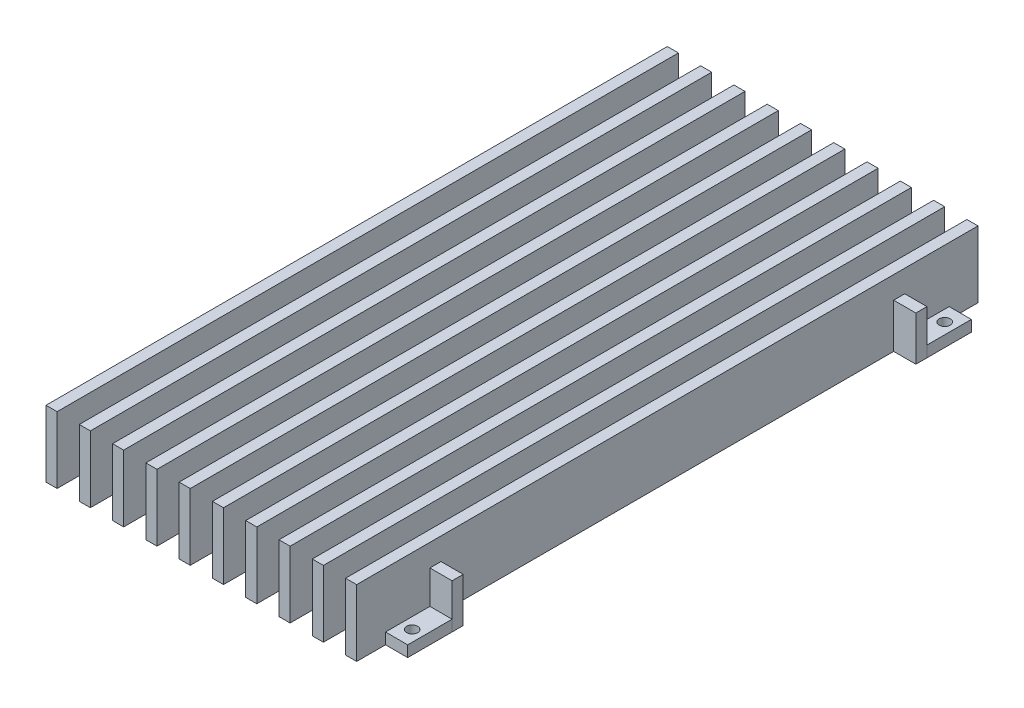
from build123d import *

# Parameters (mm, degrees)
SKETCH1_W             = 3.175
SKETCH1_H             = 19.05
BOSS_EXTRUDE1_DEPTH   = 177.8
LPATTERN1_COUNT       = 10
LPATTERN1_PITCH       = 9.525
SKETCH2_W             = 3.175
SKETCH2_H             = 12.7
BOSS_EXTRUDE2_DEPTH   = 50.8
SKETCH3_W             = 6.35
SKETCH3_H             = 12.7
BOSS_EXTRUDE3_DEPTH   = 3.175
BOSS_EXTRUDE3_2_DEPTH = 3.175
BOSS_EXTRUDE3_3_DEPTH = 3.175
BOSS_EXTRUDE3_4_DEPTH = 3.175
SKETCH4_R             = 1.5875
CUT_EXTRUDE1_DEPTH    = 3.175


with BuildPart() as part:
    # Sketch1 → Boss-Extrude1 (new body)
    with BuildSketch(Plane.XY):
        Rectangle(SKETCH1_W, SKETCH1_H)
    extrude(amount=-BOSS_EXTRUDE1_DEPTH)


with BuildPart() as lpattern1_1:
    # LPattern1: pattern copy
    add(part.part.moved(Location(Vector(1, 0, 0) * (1 * LPATTERN1_PITCH))))


with BuildPart() as lpattern1_2:
    # LPattern1: pattern copy
    add(part.part.moved(Location(Vector(1, 0, 0) * (2 * LPATTERN1_PITCH))))


with BuildPart() as lpattern1_3:
    # LPattern1: pattern copy
    add(part.part.moved(Location(Vector(1, 0, 0) * (3 * LPATTERN1_PITCH))))


with BuildPart() as lpattern1_4:
    # LPattern1: pattern copy
    add(part.part.moved(Location(Vector(1, 0, 0) * (4 * LPATTERN1_PITCH))))


with BuildPart() as lpattern1_5:
    # LPattern1: pattern copy
    add(part.part.moved(Location(Vector(1, 0, 0) * (5 * LPATTERN1_PITCH))))


with BuildPart() as lpattern1_6:
    # LPattern1: pattern copy
    add(part.part.moved(Location(Vector(1, 0, 0) * (6 * LPATTERN1_PITCH))))


with BuildPart() as lpattern1_7:
    # LPattern1: pattern copy
    add(part.part.moved(Location(Vector(1, 0, 0) * (7 * LPATTERN1_PITCH))))


with BuildPart() as lpattern1_8:
    # LPattern1: pattern copy
    add(part.part.moved(Location(Vector(1, 0, 0) * (8 * LPATTERN1_PITCH))))


with BuildPart() as lpattern1_9:
    # LPattern1: pattern copy
    add(part.part.moved(Location(Vector(1, 0, 0) * (9 * LPATTERN1_PITCH))))


with BuildPart() as part_1:
    add(part.part)

    add(lpattern1_1.part)  # Boss-Extrude2 merges LPattern1_1

    add(lpattern1_2.part)  # Boss-Extrude2 merges LPattern1_2

    add(lpattern1_3.part)  # Boss-Extrude2 merges LPattern1_3

    add(lpattern1_4.part)  # Boss-Extrude2 merges LPattern1_4

    add(lpattern1_5.part)  # Boss-Extrude2 merges LPattern1_5

    add(lpattern1_6.part)  # Boss-Extrude2 merges LPattern1_6

    add(lpattern1_7.part)  # Boss-Extrude2 merges LPattern1_7

    add(lpattern1_8.part)  # Boss-Extrude2 merges LPattern1_8

    add(lpattern1_9.part)  # Boss-Extrude2 merges LPattern1_9
    # Sketch2 → Boss-Extrude2 (add, symmetric)
    with BuildSketch(Plane.ZY.offset(-42.8625)):
        with Locations((-155.2575, -3.175)):
            Rectangle(SKETCH2_W, SKETCH2_H)
        with Locations((-22.5425, -3.175)):
            Rectangle(SKETCH2_W, SKETCH2_H)
    extrude(amount=BOSS_EXTRUDE2_DEPTH, both=True)


with BuildPart() as body_2:
    # Sketch3 → Boss-Extrude3 (new body)
    with BuildSketch(Plane.XZ.offset(9.525)):
        with Locations((-4.7625, -14.605)):
            Rectangle(SKETCH3_W, SKETCH3_H)
    extrude(amount=-BOSS_EXTRUDE3_DEPTH)


with BuildPart() as body_3:
    # Sketch3 → Boss-Extrude3 2 (new body)
    with BuildSketch(Plane.XZ.offset(9.525)):
        with Locations((-4.7625, -163.195)):
            Rectangle(SKETCH3_W, SKETCH3_H)
    extrude(amount=-BOSS_EXTRUDE3_2_DEPTH)


with BuildPart() as body_4:
    # Sketch3 → Boss-Extrude3 3 (new body)
    with BuildSketch(Plane.XZ.offset(9.525)):
        with Locations((90.4875, -163.195)):
            Rectangle(SKETCH3_W, SKETCH3_H)
    extrude(amount=-BOSS_EXTRUDE3_3_DEPTH)


with BuildPart() as body_5:
    # Sketch3 → Boss-Extrude3 4 (new body)
    with BuildSketch(Plane.XZ.offset(9.525)):
        with Locations((90.4875, -14.605)):
            Rectangle(SKETCH3_W, SKETCH3_H)
    extrude(amount=-BOSS_EXTRUDE3_4_DEPTH)


with BuildPart() as cut_extrude1_tool:
    # Sketch4 → Cut-Extrude1 (new body)
    with BuildSketch(Plane(origin=(0, -6.35, 0), x_dir=(1, 0, 0), z_dir=(0, 1, 0))):
        with Locations(Location((90.4875, 165.1, 0), (0, 0, 270))):
            Circle(SKETCH4_R)
        with Locations(Location((-4.7625, 165.1, 0), (0, 0, 270))):
            Circle(SKETCH4_R)
        with Locations(Location((-4.7625, 12.7, 0), (0, 0, 270))):
            Circle(SKETCH4_R)
        with Locations(Location((90.4875, 12.7, 0), (0, 0, 90))):
            Circle(SKETCH4_R)
    extrude(amount=-CUT_EXTRUDE1_DEPTH)


with BuildPart() as body_2_1:
    add(body_2.part)

    # Cut-Extrude1: cut by cut_extrude1_tool
    add(cut_extrude1_tool.part, mode=Mode.SUBTRACT)


with BuildPart() as body_3_1:
    add(body_3.part)

    # Cut-Extrude1: cut by cut_extrude1_tool
    add(cut_extrude1_tool.part, mode=Mode.SUBTRACT)


with BuildPart() as body_4_1:
    add(body_4.part)

    # Cut-Extrude1: cut by cut_extrude1_tool
    add(cut_extrude1_tool.part, mode=Mode.SUBTRACT)


with BuildPart() as body_5_1:
    add(body_5.part)

    # Cut-Extrude1: cut by cut_extrude1_tool
    add(cut_extrude1_tool.part, mode=Mode.SUBTRACT)


solid = Compound([part_1.part, body_2_1.part, body_3_1.part, body_4_1.part, body_5_1.part])
